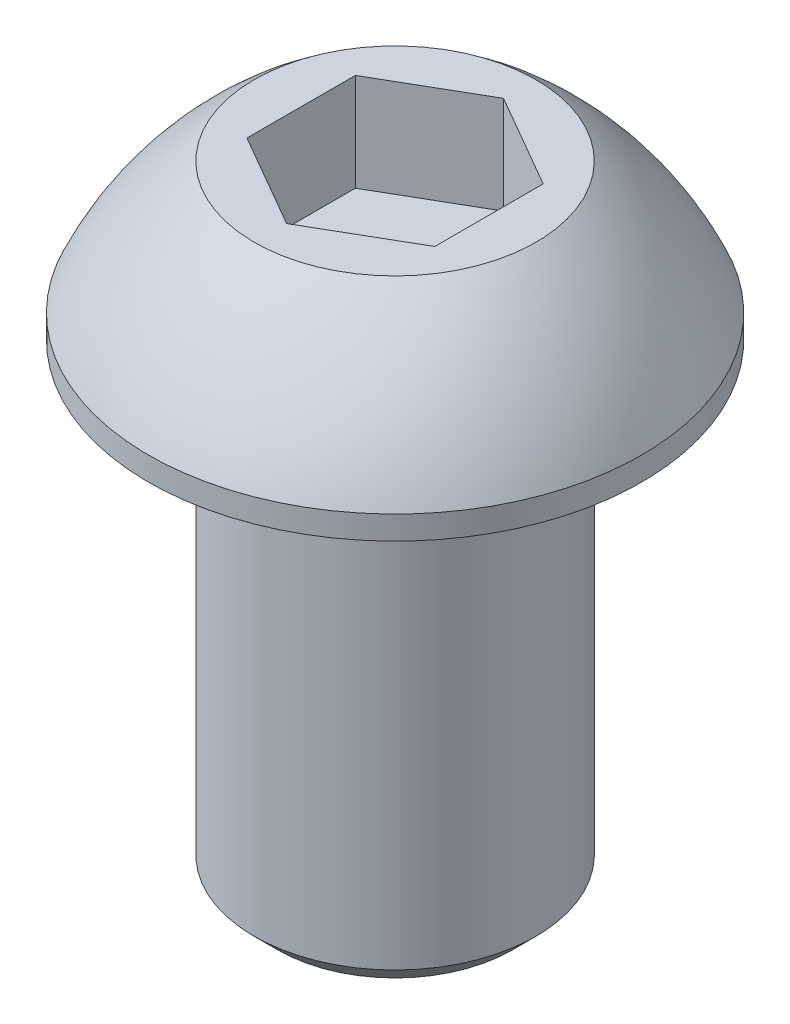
from build123d import *

# Parameters (mm, degrees)
ENL_V_MAT_EXTRU_1_DEPTH = 2.08


with BuildPart() as part:
    # Esquisse1 → R_volution1 (revolve)
    with BuildSketch(Plane.XY, mode=Mode.PRIVATE) as r_volution1_sk:
        with BuildLine():
            Line((0, -10), (2.5, -10))
            Line((2.5, -10), (3, -9.5))
            Line((3, -9.5), (3, -0.25))
            ThreePointArc((3, -0.25), (3.073223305, -0.073223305), (3.25, 0))
            Line((3.25, 0), (5.25, 0))
            Line((5.25, 0), (5.25, 0.5))
            ThreePointArc((5.25, 0.5), (4.312083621, 2.050335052), (3, 3.3))
            Line((3, 3.3), (0, 3.3))
            Line((0, 3.3), (0, -10))
        make_face()
    revolve(r_volution1_sk.sketch.rotate(Axis((0, 3.3, 0), (0, -1, 0)), 180), axis=Axis((0, 3.3, 0), (0, -1, 0)))

    # Esquisse2 → Enl_v. mat.-Extru.1 (cut)
    with BuildSketch(Plane(origin=(0, 3.3, 0), x_dir=(-1, 0, 0), z_dir=(0, 1, 0))):
        Polygon((0, -2.309401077), (2, -1.154700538), (2, 1.154700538), (0, 2.309401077), (-2, 1.154700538), (-2, -1.154700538), align=None)
    extrude(amount=-ENL_V_MAT_EXTRU_1_DEPTH, mode=Mode.SUBTRACT)


solid = part.part
